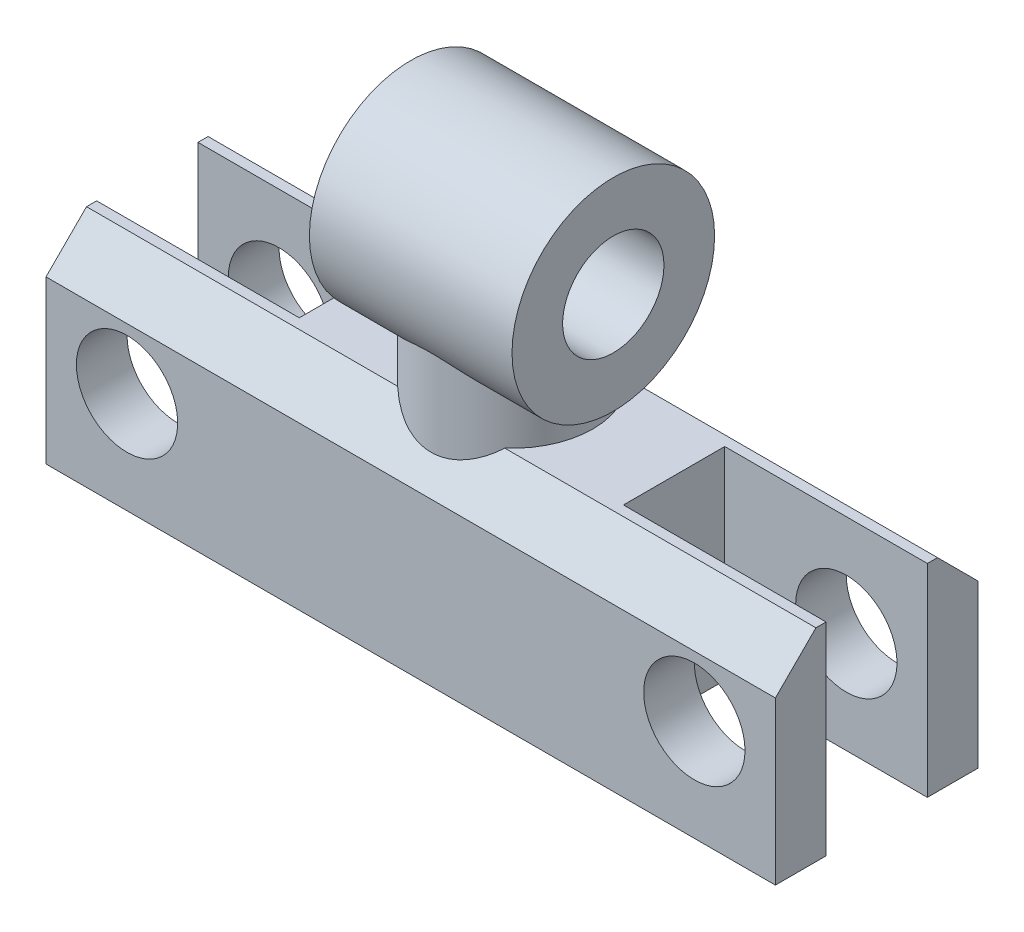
ISO-10303-21;
HEADER;
FILE_DESCRIPTION(('STEP AP214'),'2;1');
FILE_NAME('part.step','',(''),(''),'','','');
FILE_SCHEMA(('AUTOMOTIVE_DESIGN { 1 0 10303 214 1 1 1 1 }'));
ENDSEC;
DATA;
#1=APPLICATION_CONTEXT('core data for automotive mechanical design processes');
#2=APPLICATION_PROTOCOL_DEFINITION('international standard','automotive_design',2000,#1);
#3=PRODUCT_CONTEXT('',#1,'mechanical');
#4=PRODUCT('Part','Part','',(#3));
#5=PRODUCT_RELATED_PRODUCT_CATEGORY('part','',(#4));
#6=PRODUCT_DEFINITION_FORMATION('','',#4);
#7=PRODUCT_DEFINITION_CONTEXT('part definition',#1,'design');
#8=PRODUCT_DEFINITION('design','',#6,#7);
#9=PRODUCT_DEFINITION_SHAPE('','',#8);
#10=(LENGTH_UNIT() NAMED_UNIT(*) SI_UNIT(.MILLI.,.METRE.));
#11=(NAMED_UNIT(*) PLANE_ANGLE_UNIT() SI_UNIT($,.RADIAN.));
#12=(NAMED_UNIT(*) SI_UNIT($,.STERADIAN.) SOLID_ANGLE_UNIT());
#13=UNCERTAINTY_MEASURE_WITH_UNIT(LENGTH_MEASURE(1.E-05),#10,'distance_accuracy_value','');
#14=(GEOMETRIC_REPRESENTATION_CONTEXT(3) GLOBAL_UNCERTAINTY_ASSIGNED_CONTEXT((#13)) GLOBAL_UNIT_ASSIGNED_CONTEXT((#10,
#11,#12)) REPRESENTATION_CONTEXT('',''));
#15=CARTESIAN_POINT('',(0.,0.,0.));
#16=DIRECTION('',(0.,0.,1.));
#17=DIRECTION('',(1.,0.,0.));
#18=AXIS2_PLACEMENT_3D('',#15,#16,#17);
#19=CARTESIAN_POINT('',(18.,10.,5.));
#20=DIRECTION('',(0.,-1.,0.));
#21=DIRECTION('',(1.,0.,0.));
#22=AXIS2_PLACEMENT_3D('',#19,#20,#21);
#23=PLANE('',#22);
#24=DIRECTION('',(0.,0.,-1.));
#25=VECTOR('',#24,1.);
#26=CARTESIAN_POINT('',(18.,10.,5.));
#27=LINE('',#26,#25);
#28=CARTESIAN_POINT('',(18.,10.,-2.5));
#29=VERTEX_POINT('',#28);
#30=CARTESIAN_POINT('',(18.,10.,-2.99999999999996));
#31=VERTEX_POINT('',#30);
#32=EDGE_CURVE('E169',#29,#31,#27,.T.);
#33=ORIENTED_EDGE('',*,*,#32,.T.);
#34=DIRECTION('',(-1.,0.,0.));
#35=VECTOR('',#34,1.);
#36=CARTESIAN_POINT('',(18.,10.,-2.99999999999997));
#37=LINE('',#36,#35);
#38=CARTESIAN_POINT('',(2.64575131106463,9.9999999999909,-2.99999999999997));
#39=VERTEX_POINT('',#38);
#40=EDGE_CURVE('E221',#31,#39,#37,.T.);
#41=ORIENTED_EDGE('',*,*,#40,.T.);
#42=CARTESIAN_POINT('',(0.,9.99999999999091,0.));
#43=DIRECTION('',(0.,-1.,0.));
#44=DIRECTION('',(1.,0.,0.));
#45=AXIS2_PLACEMENT_3D('',#42,#43,#44);
#46=CIRCLE('',#45,4.);
#47=CARTESIAN_POINT('',(2.64575131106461,9.9999999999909,2.99999999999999));
#48=VERTEX_POINT('',#47);
#49=EDGE_CURVE('E195',#48,#39,#46,.F.);
#50=ORIENTED_EDGE('',*,*,#49,.F.);
#51=DIRECTION('',(1.,0.,0.));
#52=VECTOR('',#51,1.);
#53=CARTESIAN_POINT('',(18.,10.,2.99999999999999));
#54=LINE('',#53,#52);
#55=CARTESIAN_POINT('',(18.,10.,2.99999999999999));
#56=VERTEX_POINT('',#55);
#57=EDGE_CURVE('E215',#48,#56,#54,.T.);
#58=ORIENTED_EDGE('',*,*,#57,.T.);
#59=CARTESIAN_POINT('',(18.,10.,2.5));
#60=VERTEX_POINT('',#59);
#61=EDGE_CURVE('E193',#56,#60,#27,.T.);
#62=ORIENTED_EDGE('',*,*,#61,.T.);
#63=DIRECTION('',(1.,0.,0.));
#64=VECTOR('',#63,1.);
#65=CARTESIAN_POINT('',(18.,10.,2.5));
#66=LINE('',#65,#64);
#67=CARTESIAN_POINT('',(8.,10.,2.5));
#68=VERTEX_POINT('',#67);
#69=EDGE_CURVE('E160',#68,#60,#66,.T.);
#70=ORIENTED_EDGE('',*,*,#69,.F.);
#71=DIRECTION('',(0.,0.,1.));
#72=VECTOR('',#71,1.);
#73=CARTESIAN_POINT('',(8.,10.,2.5));
#74=LINE('',#73,#72);
#75=CARTESIAN_POINT('',(8.,10.,-2.5));
#76=VERTEX_POINT('',#75);
#77=EDGE_CURVE('E309',#76,#68,#74,.T.);
#78=ORIENTED_EDGE('',*,*,#77,.F.);
#79=DIRECTION('',(-1.,0.,0.));
#80=VECTOR('',#79,1.);
#81=CARTESIAN_POINT('',(18.,10.,-2.5));
#82=LINE('',#81,#80);
#83=EDGE_CURVE('E312',#29,#76,#82,.T.);
#84=ORIENTED_EDGE('',*,*,#83,.F.);
#85=EDGE_LOOP('',(#33,#41,#50,#58,#62,#70,#78,#84));
#86=FACE_BOUND('',#85,.T.);
#87=ADVANCED_FACE('F34',(#86),#23,.F.);
#88=CARTESIAN_POINT('',(-2.64575131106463,9.99999999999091,-2.99999999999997));
#89=VERTEX_POINT('',#88);
#90=CARTESIAN_POINT('',(-2.64575131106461,9.99999999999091,2.99999999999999));
#91=VERTEX_POINT('',#90);
#92=EDGE_CURVE('E214',#89,#91,#46,.F.);
#93=ORIENTED_EDGE('',*,*,#92,.F.);
#94=DIRECTION('',(-1.,0.,0.));
#95=VECTOR('',#94,1.);
#96=CARTESIAN_POINT('',(18.,10.,-2.99999999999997));
#97=LINE('',#96,#95);
#98=CARTESIAN_POINT('',(-18.,10.,-2.99999999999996));
#99=VERTEX_POINT('',#98);
#100=EDGE_CURVE('E219',#89,#99,#97,.T.);
#101=ORIENTED_EDGE('',*,*,#100,.T.);
#102=DIRECTION('',(0.,0.,-1.));
#103=VECTOR('',#102,1.);
#104=CARTESIAN_POINT('',(-18.,10.,5.));
#105=LINE('',#104,#103);
#106=CARTESIAN_POINT('',(-18.,10.,-2.5));
#107=VERTEX_POINT('',#106);
#108=EDGE_CURVE('E190',#107,#99,#105,.T.);
#109=ORIENTED_EDGE('',*,*,#108,.F.);
#110=DIRECTION('',(-1.,0.,0.));
#111=VECTOR('',#110,1.);
#112=CARTESIAN_POINT('',(-18.,10.,-2.5));
#113=LINE('',#112,#111);
#114=CARTESIAN_POINT('',(-8.,10.,-2.5));
#115=VERTEX_POINT('',#114);
#116=EDGE_CURVE('E287',#115,#107,#113,.T.);
#117=ORIENTED_EDGE('',*,*,#116,.F.);
#118=DIRECTION('',(0.,0.,-1.));
#119=VECTOR('',#118,1.);
#120=CARTESIAN_POINT('',(-8.,10.,-2.5));
#121=LINE('',#120,#119);
#122=CARTESIAN_POINT('',(-8.,10.,2.5));
#123=VERTEX_POINT('',#122);
#124=EDGE_CURVE('E290',#123,#115,#121,.T.);
#125=ORIENTED_EDGE('',*,*,#124,.F.);
#126=DIRECTION('',(1.,0.,0.));
#127=VECTOR('',#126,1.);
#128=CARTESIAN_POINT('',(-18.,10.,2.5));
#129=LINE('',#128,#127);
#130=CARTESIAN_POINT('',(-18.,10.,2.5));
#131=VERTEX_POINT('',#130);
#132=EDGE_CURVE('E211',#131,#123,#129,.T.);
#133=ORIENTED_EDGE('',*,*,#132,.F.);
#134=CARTESIAN_POINT('',(-18.,10.,2.99999999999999));
#135=VERTEX_POINT('',#134);
#136=EDGE_CURVE('E191',#135,#131,#105,.T.);
#137=ORIENTED_EDGE('',*,*,#136,.F.);
#138=DIRECTION('',(1.,0.,0.));
#139=VECTOR('',#138,1.);
#140=CARTESIAN_POINT('',(18.,10.,2.99999999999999));
#141=LINE('',#140,#139);
#142=EDGE_CURVE('E217',#135,#91,#141,.T.);
#143=ORIENTED_EDGE('',*,*,#142,.T.);
#144=EDGE_LOOP('',(#93,#101,#109,#117,#125,#133,#137,#143));
#145=FACE_BOUND('',#144,.T.);
#146=ADVANCED_FACE('F244',(#145),#23,.F.);
#147=CARTESIAN_POINT('',(18.,0.,5.));
#148=DIRECTION('',(-1.,0.,0.));
#149=DIRECTION('',(0.,-1.,0.));
#150=AXIS2_PLACEMENT_3D('',#147,#148,#149);
#151=PLANE('',#150);
#152=ORIENTED_EDGE('',*,*,#61,.F.);
#153=DIRECTION('',(0.,-0.707106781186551,0.707106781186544));
#154=VECTOR('',#153,1.);
#155=CARTESIAN_POINT('',(18.,7.99999999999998,5.));
#156=LINE('',#155,#154);
#157=CARTESIAN_POINT('',(18.,7.99999999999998,5.));
#158=VERTEX_POINT('',#157);
#159=EDGE_CURVE('E57',#56,#158,#156,.T.);
#160=ORIENTED_EDGE('',*,*,#159,.T.);
#161=DIRECTION('',(0.,1.,0.));
#162=VECTOR('',#161,1.);
#163=CARTESIAN_POINT('',(18.,0.,5.));
#164=LINE('',#163,#162);
#165=CARTESIAN_POINT('',(18.,0.,5.));
#166=VERTEX_POINT('',#165);
#167=EDGE_CURVE('E262',#166,#158,#164,.T.);
#168=ORIENTED_EDGE('',*,*,#167,.F.);
#169=DIRECTION('',(0.,0.,-1.));
#170=VECTOR('',#169,1.);
#171=CARTESIAN_POINT('',(18.,0.,5.));
#172=LINE('',#171,#170);
#173=CARTESIAN_POINT('',(18.,0.,2.5));
#174=VERTEX_POINT('',#173);
#175=EDGE_CURVE('E177',#166,#174,#172,.T.);
#176=ORIENTED_EDGE('',*,*,#175,.T.);
#177=DIRECTION('',(0.,1.,0.));
#178=VECTOR('',#177,1.);
#179=CARTESIAN_POINT('',(18.,0.,2.5));
#180=LINE('',#179,#178);
#181=EDGE_CURVE('E208',#174,#60,#180,.T.);
#182=ORIENTED_EDGE('',*,*,#181,.T.);
#183=EDGE_LOOP('',(#152,#160,#168,#176,#182));
#184=FACE_BOUND('',#183,.T.);
#185=ADVANCED_FACE('F357',(#184),#151,.F.);
#186=CARTESIAN_POINT('',(14.,5.,5.));
#187=DIRECTION('',(0.,0.,-1.));
#188=DIRECTION('',(-1.,0.,0.));
#189=AXIS2_PLACEMENT_3D('',#186,#187,#188);
#190=CYLINDRICAL_SURFACE('',#189,2.5);
#191=CARTESIAN_POINT('',(14.,5.,2.5));
#192=DIRECTION('',(0.,0.,1.));
#193=DIRECTION('',(1.,0.,0.));
#194=AXIS2_PLACEMENT_3D('',#191,#192,#193);
#195=CIRCLE('',#194,2.5);
#196=CARTESIAN_POINT('',(16.5,5.,2.5));
#197=VERTEX_POINT('',#196);
#198=EDGE_CURVE('E207',#197,#197,#195,.T.);
#199=ORIENTED_EDGE('',*,*,#198,.F.);
#200=EDGE_LOOP('',(#199));
#201=FACE_BOUND('',#200,.T.);
#202=CARTESIAN_POINT('',(14.,5.,5.));
#203=DIRECTION('',(0.,0.,1.));
#204=DIRECTION('',(1.,0.,0.));
#205=AXIS2_PLACEMENT_3D('',#202,#203,#204);
#206=CIRCLE('',#205,2.5);
#207=CARTESIAN_POINT('',(16.5,5.,5.));
#208=VERTEX_POINT('',#207);
#209=EDGE_CURVE('E263',#208,#208,#206,.T.);
#210=ORIENTED_EDGE('',*,*,#209,.T.);
#211=EDGE_LOOP('',(#210));
#212=FACE_BOUND('',#211,.T.);
#213=ADVANCED_FACE('F372',(#201,#212),#190,.F.);
#214=CARTESIAN_POINT('',(-18.,0.,5.));
#215=DIRECTION('',(1.,0.,0.));
#216=DIRECTION('',(0.,1.,0.));
#217=AXIS2_PLACEMENT_3D('',#214,#215,#216);
#218=PLANE('',#217);
#219=ORIENTED_EDGE('',*,*,#108,.T.);
#220=DIRECTION('',(0.,0.707106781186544,0.707106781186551));
#221=VECTOR('',#220,1.);
#222=CARTESIAN_POINT('',(-18.,10.,-2.99999999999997));
#223=LINE('',#222,#221);
#224=CARTESIAN_POINT('',(-18.,8.00000000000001,-5.));
#225=VERTEX_POINT('',#224);
#226=EDGE_CURVE('E224',#99,#225,#223,.F.);
#227=ORIENTED_EDGE('',*,*,#226,.T.);
#228=DIRECTION('',(0.,-1.,0.));
#229=VECTOR('',#228,1.);
#230=CARTESIAN_POINT('',(-18.,0.,-5.));
#231=LINE('',#230,#229);
#232=CARTESIAN_POINT('',(-18.,0.,-5.));
#233=VERTEX_POINT('',#232);
#234=EDGE_CURVE('E256',#225,#233,#231,.T.);
#235=ORIENTED_EDGE('',*,*,#234,.T.);
#236=DIRECTION('',(0.,0.,-1.));
#237=VECTOR('',#236,1.);
#238=CARTESIAN_POINT('',(-18.,0.,5.));
#239=LINE('',#238,#237);
#240=CARTESIAN_POINT('',(-18.,0.,-2.5));
#241=VERTEX_POINT('',#240);
#242=EDGE_CURVE('E181',#241,#233,#239,.T.);
#243=ORIENTED_EDGE('',*,*,#242,.F.);
#244=DIRECTION('',(0.,1.,0.));
#245=VECTOR('',#244,1.);
#246=CARTESIAN_POINT('',(-18.,0.,-2.5));
#247=LINE('',#246,#245);
#248=EDGE_CURVE('E200',#241,#107,#247,.T.);
#249=ORIENTED_EDGE('',*,*,#248,.T.);
#250=EDGE_LOOP('',(#219,#227,#235,#243,#249));
#251=FACE_BOUND('',#250,.T.);
#252=ADVANCED_FACE('F254',(#251),#218,.F.);
#253=CARTESIAN_POINT('',(-14.,5.,5.));
#254=DIRECTION('',(0.,0.,-1.));
#255=DIRECTION('',(-1.,0.,0.));
#256=AXIS2_PLACEMENT_3D('',#253,#254,#255);
#257=CYLINDRICAL_SURFACE('',#256,2.5);
#258=CARTESIAN_POINT('',(-14.,5.,-2.5));
#259=DIRECTION('',(0.,0.,-1.));
#260=DIRECTION('',(-1.,0.,0.));
#261=AXIS2_PLACEMENT_3D('',#258,#259,#260);
#262=CIRCLE('',#261,2.5);
#263=CARTESIAN_POINT('',(-16.5,5.,-2.5));
#264=VERTEX_POINT('',#263);
#265=EDGE_CURVE('E199',#264,#264,#262,.T.);
#266=ORIENTED_EDGE('',*,*,#265,.F.);
#267=EDGE_LOOP('',(#266));
#268=FACE_BOUND('',#267,.T.);
#269=CARTESIAN_POINT('',(-14.,5.,-5.));
#270=DIRECTION('',(0.,0.,1.));
#271=DIRECTION('',(-1.,0.,0.));
#272=AXIS2_PLACEMENT_3D('',#269,#270,#271);
#273=CIRCLE('',#272,2.5);
#274=CARTESIAN_POINT('',(-16.5,5.,-5.));
#275=VERTEX_POINT('',#274);
#276=EDGE_CURVE('E203',#275,#275,#273,.T.);
#277=ORIENTED_EDGE('',*,*,#276,.F.);
#278=EDGE_LOOP('',(#277));
#279=FACE_BOUND('',#278,.T.);
#280=ADVANCED_FACE('F419',(#268,#279),#257,.F.);
#281=CARTESIAN_POINT('',(18.,10.,5.));
#282=DIRECTION('',(0.,0.,1.));
#283=DIRECTION('',(1.,0.,0.));
#284=AXIS2_PLACEMENT_3D('',#281,#282,#283);
#285=PLANE('',#284);
#286=ORIENTED_EDGE('',*,*,#209,.F.);
#287=EDGE_LOOP('',(#286));
#288=FACE_BOUND('',#287,.T.);
#289=ORIENTED_EDGE('',*,*,#167,.T.);
#290=DIRECTION('',(-1.,0.,0.));
#291=VECTOR('',#290,1.);
#292=CARTESIAN_POINT('',(-18.,7.99999999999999,5.));
#293=LINE('',#292,#291);
#294=CARTESIAN_POINT('',(-18.,7.99999999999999,5.));
#295=VERTEX_POINT('',#294);
#296=EDGE_CURVE('E230',#158,#295,#293,.T.);
#297=ORIENTED_EDGE('',*,*,#296,.T.);
#298=DIRECTION('',(0.,-1.,0.));
#299=VECTOR('',#298,1.);
#300=CARTESIAN_POINT('',(-18.,0.,5.));
#301=LINE('',#300,#299);
#302=CARTESIAN_POINT('',(-18.,0.,5.));
#303=VERTEX_POINT('',#302);
#304=EDGE_CURVE('E182',#295,#303,#301,.T.);
#305=ORIENTED_EDGE('',*,*,#304,.T.);
#306=DIRECTION('',(1.,0.,0.));
#307=VECTOR('',#306,1.);
#308=CARTESIAN_POINT('',(-18.,0.,5.));
#309=LINE('',#308,#307);
#310=EDGE_CURVE('E178',#303,#166,#309,.T.);
#311=ORIENTED_EDGE('',*,*,#310,.T.);
#312=EDGE_LOOP('',(#289,#297,#305,#311));
#313=FACE_BOUND('',#312,.T.);
#314=CARTESIAN_POINT('',(-14.,5.,5.));
#315=DIRECTION('',(0.,0.,1.));
#316=DIRECTION('',(-1.,0.,0.));
#317=AXIS2_PLACEMENT_3D('',#314,#315,#316);
#318=CIRCLE('',#317,2.5);
#319=CARTESIAN_POINT('',(-16.5,5.,5.));
#320=VERTEX_POINT('',#319);
#321=EDGE_CURVE('E271',#320,#320,#318,.T.);
#322=ORIENTED_EDGE('',*,*,#321,.F.);
#323=EDGE_LOOP('',(#322));
#324=FACE_BOUND('',#323,.T.);
#325=ADVANCED_FACE('F368',(#288,#313,#324),#285,.T.);
#326=CARTESIAN_POINT('',(18.,10.,-5.));
#327=DIRECTION('',(0.,0.,1.));
#328=DIRECTION('',(1.,0.,0.));
#329=AXIS2_PLACEMENT_3D('',#326,#327,#328);
#330=PLANE('',#329);
#331=CARTESIAN_POINT('',(14.,5.,-5.));
#332=DIRECTION('',(0.,0.,1.));
#333=DIRECTION('',(1.,0.,0.));
#334=AXIS2_PLACEMENT_3D('',#331,#332,#333);
#335=CIRCLE('',#334,2.5);
#336=CARTESIAN_POINT('',(16.5,5.,-5.));
#337=VERTEX_POINT('',#336);
#338=EDGE_CURVE('E268',#337,#337,#335,.T.);
#339=ORIENTED_EDGE('',*,*,#338,.T.);
#340=EDGE_LOOP('',(#339));
#341=FACE_BOUND('',#340,.T.);
#342=ORIENTED_EDGE('',*,*,#234,.F.);
#343=DIRECTION('',(1.,0.,0.));
#344=VECTOR('',#343,1.);
#345=CARTESIAN_POINT('',(18.,8.,-5.));
#346=LINE('',#345,#344);
#347=CARTESIAN_POINT('',(18.,8.,-5.));
#348=VERTEX_POINT('',#347);
#349=EDGE_CURVE('E226',#225,#348,#346,.T.);
#350=ORIENTED_EDGE('',*,*,#349,.T.);
#351=DIRECTION('',(0.,1.,0.));
#352=VECTOR('',#351,1.);
#353=CARTESIAN_POINT('',(18.,0.,-5.));
#354=LINE('',#353,#352);
#355=CARTESIAN_POINT('',(18.,0.,-5.));
#356=VERTEX_POINT('',#355);
#357=EDGE_CURVE('E261',#356,#348,#354,.T.);
#358=ORIENTED_EDGE('',*,*,#357,.F.);
#359=DIRECTION('',(1.,0.,0.));
#360=VECTOR('',#359,1.);
#361=CARTESIAN_POINT('',(-18.,0.,-5.));
#362=LINE('',#361,#360);
#363=EDGE_CURVE('E175',#233,#356,#362,.T.);
#364=ORIENTED_EDGE('',*,*,#363,.F.);
#365=EDGE_LOOP('',(#342,#350,#358,#364));
#366=FACE_BOUND('',#365,.T.);
#367=ORIENTED_EDGE('',*,*,#276,.T.);
#368=EDGE_LOOP('',(#367));
#369=FACE_BOUND('',#368,.T.);
#370=ADVANCED_FACE('F259',(#341,#366,#369),#330,.F.);
#371=ORIENTED_EDGE('',*,*,#357,.T.);
#372=DIRECTION('',(0.,-0.707106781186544,-0.707106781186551));
#373=VECTOR('',#372,1.);
#374=CARTESIAN_POINT('',(18.,10.,-2.99999999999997));
#375=LINE('',#374,#373);
#376=EDGE_CURVE('E228',#348,#31,#375,.F.);
#377=ORIENTED_EDGE('',*,*,#376,.T.);
#378=ORIENTED_EDGE('',*,*,#32,.F.);
#379=DIRECTION('',(0.,1.,0.));
#380=VECTOR('',#379,1.);
#381=CARTESIAN_POINT('',(18.,0.,-2.5));
#382=LINE('',#381,#380);
#383=CARTESIAN_POINT('',(18.,0.,-2.5));
#384=VERTEX_POINT('',#383);
#385=EDGE_CURVE('E153',#384,#29,#382,.T.);
#386=ORIENTED_EDGE('',*,*,#385,.F.);
#387=EDGE_CURVE('E166',#384,#356,#172,.T.);
#388=ORIENTED_EDGE('',*,*,#387,.T.);
#389=EDGE_LOOP('',(#371,#377,#378,#386,#388));
#390=FACE_BOUND('',#389,.T.);
#391=ADVANCED_FACE('F165',(#390),#151,.F.);
#392=ORIENTED_EDGE('',*,*,#304,.F.);
#393=DIRECTION('',(0.,0.707106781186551,-0.707106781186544));
#394=VECTOR('',#393,1.);
#395=CARTESIAN_POINT('',(-18.,7.99999999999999,5.));
#396=LINE('',#395,#394);
#397=EDGE_CURVE('E49',#295,#135,#396,.T.);
#398=ORIENTED_EDGE('',*,*,#397,.T.);
#399=ORIENTED_EDGE('',*,*,#136,.T.);
#400=DIRECTION('',(0.,1.,0.));
#401=VECTOR('',#400,1.);
#402=CARTESIAN_POINT('',(-18.,0.,2.5));
#403=LINE('',#402,#401);
#404=CARTESIAN_POINT('',(-18.,0.,2.5));
#405=VERTEX_POINT('',#404);
#406=EDGE_CURVE('E278',#405,#131,#403,.T.);
#407=ORIENTED_EDGE('',*,*,#406,.F.);
#408=EDGE_CURVE('E187',#303,#405,#239,.T.);
#409=ORIENTED_EDGE('',*,*,#408,.F.);
#410=EDGE_LOOP('',(#392,#398,#399,#407,#409));
#411=FACE_BOUND('',#410,.T.);
#412=ADVANCED_FACE('F360',(#411),#218,.F.);
#413=CARTESIAN_POINT('',(-18.,0.,5.));
#414=DIRECTION('',(0.,1.,0.));
#415=DIRECTION('',(-1.,0.,0.));
#416=AXIS2_PLACEMENT_3D('',#413,#414,#415);
#417=PLANE('',#416);
#418=DIRECTION('',(0.,0.,1.));
#419=VECTOR('',#418,1.);
#420=CARTESIAN_POINT('',(8.,0.,2.5));
#421=LINE('',#420,#419);
#422=CARTESIAN_POINT('',(8.,0.,-2.5));
#423=VERTEX_POINT('',#422);
#424=CARTESIAN_POINT('',(8.,0.,2.5));
#425=VERTEX_POINT('',#424);
#426=EDGE_CURVE('E159',#423,#425,#421,.T.);
#427=ORIENTED_EDGE('',*,*,#426,.T.);
#428=DIRECTION('',(1.,0.,0.));
#429=VECTOR('',#428,1.);
#430=CARTESIAN_POINT('',(18.,0.,2.5));
#431=LINE('',#430,#429);
#432=EDGE_CURVE('E170',#425,#174,#431,.T.);
#433=ORIENTED_EDGE('',*,*,#432,.T.);
#434=ORIENTED_EDGE('',*,*,#175,.F.);
#435=ORIENTED_EDGE('',*,*,#310,.F.);
#436=ORIENTED_EDGE('',*,*,#408,.T.);
#437=DIRECTION('',(1.,0.,0.));
#438=VECTOR('',#437,1.);
#439=CARTESIAN_POINT('',(-18.,0.,2.5));
#440=LINE('',#439,#438);
#441=CARTESIAN_POINT('',(-8.,0.,2.5));
#442=VERTEX_POINT('',#441);
#443=EDGE_CURVE('E289',#405,#442,#440,.T.);
#444=ORIENTED_EDGE('',*,*,#443,.T.);
#445=DIRECTION('',(0.,0.,-1.));
#446=VECTOR('',#445,1.);
#447=CARTESIAN_POINT('',(-8.,0.,-2.5));
#448=LINE('',#447,#446);
#449=CARTESIAN_POINT('',(-8.,0.,-2.5));
#450=VERTEX_POINT('',#449);
#451=EDGE_CURVE('E297',#442,#450,#448,.T.);
#452=ORIENTED_EDGE('',*,*,#451,.T.);
#453=DIRECTION('',(-1.,0.,0.));
#454=VECTOR('',#453,1.);
#455=CARTESIAN_POINT('',(-18.,0.,-2.5));
#456=LINE('',#455,#454);
#457=EDGE_CURVE('E282',#450,#241,#456,.T.);
#458=ORIENTED_EDGE('',*,*,#457,.T.);
#459=ORIENTED_EDGE('',*,*,#242,.T.);
#460=ORIENTED_EDGE('',*,*,#363,.T.);
#461=ORIENTED_EDGE('',*,*,#387,.F.);
#462=DIRECTION('',(-1.,0.,0.));
#463=VECTOR('',#462,1.);
#464=CARTESIAN_POINT('',(18.,0.,-2.5));
#465=LINE('',#464,#463);
#466=EDGE_CURVE('E149',#384,#423,#465,.T.);
#467=ORIENTED_EDGE('',*,*,#466,.T.);
#468=EDGE_LOOP('',(#427,#433,#434,#435,#436,#444,#452,#458,#459,#460,#461,#467));
#469=FACE_BOUND('',#468,.T.);
#470=ADVANCED_FACE('F172',(#469),#417,.F.);
#471=CARTESIAN_POINT('',(14.,5.,-2.5));
#472=DIRECTION('',(0.,0.,-1.));
#473=DIRECTION('',(-1.,0.,0.));
#474=AXIS2_PLACEMENT_3D('',#471,#472,#473);
#475=CIRCLE('',#474,2.5);
#476=CARTESIAN_POINT('',(11.5,5.,-2.5));
#477=VERTEX_POINT('',#476);
#478=EDGE_CURVE('E204',#477,#477,#475,.T.);
#479=ORIENTED_EDGE('',*,*,#478,.F.);
#480=EDGE_LOOP('',(#479));
#481=FACE_BOUND('',#480,.T.);
#482=ORIENTED_EDGE('',*,*,#338,.F.);
#483=EDGE_LOOP('',(#482));
#484=FACE_BOUND('',#483,.T.);
#485=ADVANCED_FACE('F378',(#481,#484),#190,.F.);
#486=CARTESIAN_POINT('',(-14.,5.,2.5));
#487=DIRECTION('',(0.,0.,1.));
#488=DIRECTION('',(1.,0.,0.));
#489=AXIS2_PLACEMENT_3D('',#486,#487,#488);
#490=CIRCLE('',#489,2.5);
#491=CARTESIAN_POINT('',(-11.5,5.,2.5));
#492=VERTEX_POINT('',#491);
#493=EDGE_CURVE('E196',#492,#492,#490,.T.);
#494=ORIENTED_EDGE('',*,*,#493,.F.);
#495=EDGE_LOOP('',(#494));
#496=FACE_BOUND('',#495,.T.);
#497=ORIENTED_EDGE('',*,*,#321,.T.);
#498=EDGE_LOOP('',(#497));
#499=FACE_BOUND('',#498,.T.);
#500=ADVANCED_FACE('F409',(#496,#499),#257,.F.);
#501=CARTESIAN_POINT('',(-18.,0.,-2.5));
#502=DIRECTION('',(0.,0.,-1.));
#503=DIRECTION('',(-1.,0.,0.));
#504=AXIS2_PLACEMENT_3D('',#501,#502,#503);
#505=PLANE('',#504);
#506=ORIENTED_EDGE('',*,*,#265,.T.);
#507=EDGE_LOOP('',(#506));
#508=FACE_BOUND('',#507,.T.);
#509=ORIENTED_EDGE('',*,*,#116,.T.);
#510=ORIENTED_EDGE('',*,*,#248,.F.);
#511=ORIENTED_EDGE('',*,*,#457,.F.);
#512=DIRECTION('',(0.,1.,0.));
#513=VECTOR('',#512,1.);
#514=CARTESIAN_POINT('',(-8.,0.,-2.5));
#515=LINE('',#514,#513);
#516=EDGE_CURVE('E284',#450,#115,#515,.T.);
#517=ORIENTED_EDGE('',*,*,#516,.T.);
#518=EDGE_LOOP('',(#509,#510,#511,#517));
#519=FACE_BOUND('',#518,.T.);
#520=ADVANCED_FACE('F405',(#508,#519),#505,.F.);
#521=CARTESIAN_POINT('',(-8.,0.,-2.5));
#522=DIRECTION('',(1.,0.,0.));
#523=DIRECTION('',(0.,1.,0.));
#524=AXIS2_PLACEMENT_3D('',#521,#522,#523);
#525=PLANE('',#524);
#526=ORIENTED_EDGE('',*,*,#124,.T.);
#527=ORIENTED_EDGE('',*,*,#516,.F.);
#528=ORIENTED_EDGE('',*,*,#451,.F.);
#529=DIRECTION('',(0.,1.,0.));
#530=VECTOR('',#529,1.);
#531=CARTESIAN_POINT('',(-8.,0.,2.5));
#532=LINE('',#531,#530);
#533=EDGE_CURVE('E281',#442,#123,#532,.T.);
#534=ORIENTED_EDGE('',*,*,#533,.T.);
#535=EDGE_LOOP('',(#526,#527,#528,#534));
#536=FACE_BOUND('',#535,.T.);
#537=ADVANCED_FACE('F408',(#536),#525,.F.);
#538=CARTESIAN_POINT('',(-18.,0.,2.5));
#539=DIRECTION('',(0.,0.,1.));
#540=DIRECTION('',(1.,0.,0.));
#541=AXIS2_PLACEMENT_3D('',#538,#539,#540);
#542=PLANE('',#541);
#543=ORIENTED_EDGE('',*,*,#493,.T.);
#544=EDGE_LOOP('',(#543));
#545=FACE_BOUND('',#544,.T.);
#546=ORIENTED_EDGE('',*,*,#132,.T.);
#547=ORIENTED_EDGE('',*,*,#533,.F.);
#548=ORIENTED_EDGE('',*,*,#443,.F.);
#549=ORIENTED_EDGE('',*,*,#406,.T.);
#550=EDGE_LOOP('',(#546,#547,#548,#549));
#551=FACE_BOUND('',#550,.T.);
#552=ADVANCED_FACE('F402',(#545,#551),#542,.F.);
#553=CARTESIAN_POINT('',(18.,0.,2.5));
#554=DIRECTION('',(0.,0.,1.));
#555=DIRECTION('',(1.,0.,0.));
#556=AXIS2_PLACEMENT_3D('',#553,#554,#555);
#557=PLANE('',#556);
#558=ORIENTED_EDGE('',*,*,#198,.T.);
#559=EDGE_LOOP('',(#558));
#560=FACE_BOUND('',#559,.T.);
#561=ORIENTED_EDGE('',*,*,#69,.T.);
#562=ORIENTED_EDGE('',*,*,#181,.F.);
#563=ORIENTED_EDGE('',*,*,#432,.F.);
#564=DIRECTION('',(0.,1.,0.));
#565=VECTOR('',#564,1.);
#566=CARTESIAN_POINT('',(8.,0.,2.5));
#567=LINE('',#566,#565);
#568=EDGE_CURVE('E303',#425,#68,#567,.T.);
#569=ORIENTED_EDGE('',*,*,#568,.T.);
#570=EDGE_LOOP('',(#561,#562,#563,#569));
#571=FACE_BOUND('',#570,.T.);
#572=ADVANCED_FACE('F390',(#560,#571),#557,.F.);
#573=CARTESIAN_POINT('',(8.,0.,2.5));
#574=DIRECTION('',(-1.,0.,0.));
#575=DIRECTION('',(0.,0.,1.));
#576=AXIS2_PLACEMENT_3D('',#573,#574,#575);
#577=PLANE('',#576);
#578=ORIENTED_EDGE('',*,*,#77,.T.);
#579=ORIENTED_EDGE('',*,*,#568,.F.);
#580=ORIENTED_EDGE('',*,*,#426,.F.);
#581=DIRECTION('',(0.,1.,0.));
#582=VECTOR('',#581,1.);
#583=CARTESIAN_POINT('',(8.,0.,-2.5));
#584=LINE('',#583,#582);
#585=EDGE_CURVE('E155',#423,#76,#584,.T.);
#586=ORIENTED_EDGE('',*,*,#585,.T.);
#587=EDGE_LOOP('',(#578,#579,#580,#586));
#588=FACE_BOUND('',#587,.T.);
#589=ADVANCED_FACE('F393',(#588),#577,.F.);
#590=CARTESIAN_POINT('',(18.,0.,-2.5));
#591=DIRECTION('',(0.,0.,-1.));
#592=DIRECTION('',(-1.,0.,0.));
#593=AXIS2_PLACEMENT_3D('',#590,#591,#592);
#594=PLANE('',#593);
#595=ORIENTED_EDGE('',*,*,#478,.T.);
#596=EDGE_LOOP('',(#595));
#597=FACE_BOUND('',#596,.T.);
#598=ORIENTED_EDGE('',*,*,#83,.T.);
#599=ORIENTED_EDGE('',*,*,#585,.F.);
#600=ORIENTED_EDGE('',*,*,#466,.F.);
#601=ORIENTED_EDGE('',*,*,#385,.T.);
#602=EDGE_LOOP('',(#598,#599,#600,#601));
#603=FACE_BOUND('',#602,.T.);
#604=ADVANCED_FACE('F152',(#597,#603),#594,.F.);
#605=CARTESIAN_POINT('',(1.68651824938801E-10,500000.,0.));
#606=DIRECTION('',(0.,-1.,0.));
#607=DIRECTION('',(1.,0.,0.));
#608=AXIS2_PLACEMENT_3D('',#605,#606,#607);
#609=CYLINDRICAL_SURFACE('',#608,4.);
#610=ORIENTED_EDGE('',*,*,#49,.T.);
#611=CARTESIAN_POINT('',(0.,13.0000000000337,0.));
#612=DIRECTION('',(0.,-0.707106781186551,0.707106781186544));
#613=DIRECTION('',(0.,-0.707106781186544,-0.707106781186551));
#614=AXIS2_PLACEMENT_3D('',#611,#612,#613);
#615=ELLIPSE('',#614,5.65685424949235,4.);
#616=EDGE_CURVE('E42',#39,#89,#615,.F.);
#617=ORIENTED_EDGE('',*,*,#616,.T.);
#618=ORIENTED_EDGE('',*,*,#92,.T.);
#619=CARTESIAN_POINT('',(0.,12.9999999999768,0.));
#620=DIRECTION('',(0.,0.707106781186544,0.707106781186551));
#621=DIRECTION('',(0.,-0.707106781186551,0.707106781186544));
#622=AXIS2_PLACEMENT_3D('',#619,#620,#621);
#623=ELLIPSE('',#622,5.65685424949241,4.);
#624=EDGE_CURVE('E11',#91,#48,#623,.T.);
#625=ORIENTED_EDGE('',*,*,#624,.T.);
#626=EDGE_LOOP('',(#610,#617,#618,#625));
#627=FACE_BOUND('',#626,.T.);
#628=CARTESIAN_POINT('',(4.,11.2500000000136,0.));
#629=CARTESIAN_POINT('',(3.99999923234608,11.2500007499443,-0.0960463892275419));
#630=CARTESIAN_POINT('',(3.99653429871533,11.2527739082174,-0.192107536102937));
#631=CARTESIAN_POINT('',(3.98273418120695,11.263803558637,-0.383456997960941));
#632=CARTESIAN_POINT('',(3.97239536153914,11.2720629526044,-0.478744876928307));
#633=CARTESIAN_POINT('',(3.945004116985,11.2938938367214,-0.667896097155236));
#634=CARTESIAN_POINT('',(3.92794075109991,11.3074739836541,-0.761756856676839));
#635=CARTESIAN_POINT('',(3.88738981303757,11.3396385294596,-0.947221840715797));
#636=CARTESIAN_POINT('',(3.86389932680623,11.3582251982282,-1.03882502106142));
#637=CARTESIAN_POINT('',(3.78466700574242,11.4206489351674,-1.30807557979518));
#638=CARTESIAN_POINT('',(3.71994896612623,11.471324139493,-1.48159866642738));
#639=CARTESIAN_POINT('',(3.56974964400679,11.5872932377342,-1.81389737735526));
#640=CARTESIAN_POINT('',(3.48426829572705,11.6525871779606,-1.97267295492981));
#641=CARTESIAN_POINT('',(3.32631313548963,11.7708717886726,-2.22486392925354));
#642=CARTESIAN_POINT('',(3.25865263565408,11.8209559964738,-2.32274021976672));
#643=CARTESIAN_POINT('',(3.11599426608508,11.9248379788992,-2.51087921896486));
#644=CARTESIAN_POINT('',(3.04099644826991,11.978635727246,-2.60114198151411));
#645=CARTESIAN_POINT('',(2.88403632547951,12.0889261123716,-2.77417073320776));
#646=CARTESIAN_POINT('',(2.80205409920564,12.145426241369,-2.85691378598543));
#647=CARTESIAN_POINT('',(2.63176020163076,12.2597397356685,-3.01451382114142));
#648=CARTESIAN_POINT('',(2.54345098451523,12.3175525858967,-3.08937383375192));
#649=CARTESIAN_POINT('',(2.35925936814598,12.4341206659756,-3.23229007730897));
#650=CARTESIAN_POINT('',(2.26327942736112,12.4928763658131,-3.30022025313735));
#651=CARTESIAN_POINT('',(2.06501675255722,12.6088706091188,-3.42776995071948));
#652=CARTESIAN_POINT('',(1.96273204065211,12.6661086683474,-3.48738684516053));
#653=CARTESIAN_POINT('',(1.75207248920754,12.7769959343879,-3.5978250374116));
#654=CARTESIAN_POINT('',(1.64371523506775,12.8306546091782,-3.64867015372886));
#655=CARTESIAN_POINT('',(1.42061730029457,12.9321253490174,-3.74117870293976));
#656=CARTESIAN_POINT('',(1.3058821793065,12.9799423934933,-3.78284998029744));
#657=CARTESIAN_POINT('',(1.05228957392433,13.0732978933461,-3.86171422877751));
#658=CARTESIAN_POINT('',(0.912389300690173,13.1174283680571,-3.89730775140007));
#659=CARTESIAN_POINT('',(0.625561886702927,13.1885993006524,-3.95346969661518));
#660=CARTESIAN_POINT('',(0.478652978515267,13.2156817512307,-3.97407505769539));
#661=CARTESIAN_POINT('',(0.179618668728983,13.2483160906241,-3.9987963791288));
#662=CARTESIAN_POINT('',(0.027458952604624,13.2536781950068,-4.00276700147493));
#663=CARTESIAN_POINT('',(-0.275411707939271,13.2412006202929,-3.99338954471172));
#664=CARTESIAN_POINT('',(-0.426121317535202,13.2233413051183,-3.9800268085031));
#665=CARTESIAN_POINT('',(-0.744439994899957,13.163585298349,-3.93390695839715));
#666=CARTESIAN_POINT('',(-0.910998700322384,13.1183617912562,-3.89843994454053));
#667=CARTESIAN_POINT('',(-1.23308848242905,13.0100521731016,-3.80888715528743));
#668=CARTESIAN_POINT('',(-1.38858523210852,12.9469132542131,-3.75474623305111));
#669=CARTESIAN_POINT('',(-1.64978371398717,12.8277236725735,-3.64593083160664));
#670=CARTESIAN_POINT('',(-1.75810078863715,12.773946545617,-3.59488537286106));
#671=CARTESIAN_POINT('',(-1.9684490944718,12.6629681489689,-3.48415594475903));
#672=CARTESIAN_POINT('',(-2.07047738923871,12.6057653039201,-3.42446798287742));
#673=CARTESIAN_POINT('',(-2.2683872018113,12.4897937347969,-3.29671153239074));
#674=CARTESIAN_POINT('',(-2.36426139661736,12.4310232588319,-3.22863333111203));
#675=CARTESIAN_POINT('',(-2.54966735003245,12.3135466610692,-3.08431402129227));
#676=CARTESIAN_POINT('',(-2.63920014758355,12.2548405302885,-3.00807425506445));
#677=CARTESIAN_POINT('',(-2.81401012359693,12.1372929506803,-2.84534419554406));
#678=CARTESIAN_POINT('',(-2.8991090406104,12.0784900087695,-2.75863401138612));
#679=CARTESIAN_POINT('',(-3.06191309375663,11.9637452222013,-2.57673993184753));
#680=CARTESIAN_POINT('',(-3.13961713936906,11.9078038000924,-2.48155479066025));
#681=CARTESIAN_POINT('',(-3.28675730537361,11.8002516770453,-2.28307653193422));
#682=CARTESIAN_POINT('',(-3.35621195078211,11.7486313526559,-2.1798024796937));
#683=CARTESIAN_POINT('',(-3.4861249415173,11.6509524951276,-1.96536649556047));
#684=CARTESIAN_POINT('',(-3.54658734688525,11.6048914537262,-1.85420815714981));
#685=CARTESIAN_POINT('',(-3.6810867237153,11.5015450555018,-1.57560055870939));
#686=CARTESIAN_POINT('',(-3.75002209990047,11.4477720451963,-1.40425498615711));
#687=CARTESIAN_POINT('',(-3.83572935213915,11.3804499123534,-1.13837354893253));
#688=CARTESIAN_POINT('',(-3.86135253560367,11.3602293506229,-1.04825004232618));
#689=CARTESIAN_POINT('',(-3.90636305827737,11.3246086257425,-0.865540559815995));
#690=CARTESIAN_POINT('',(-3.92575331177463,11.3092062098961,-0.772955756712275));
#691=CARTESIAN_POINT('',(-3.95808051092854,11.2834815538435,-0.585412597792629));
#692=CARTESIAN_POINT('',(-3.97097979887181,11.2731889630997,-0.490443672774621));
#693=CARTESIAN_POINT('',(-3.98993092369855,11.2580548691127,-0.299430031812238));
#694=CARTESIAN_POINT('',(-3.99598557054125,11.2532111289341,-0.203385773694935));
#695=CARTESIAN_POINT('',(-4.00114189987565,11.2490867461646,-0.0109789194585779));
#696=CARTESIAN_POINT('',(-4.00024314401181,11.2498064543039,0.0853836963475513));
#697=CARTESIAN_POINT('',(-3.99151942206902,11.2567822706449,0.277564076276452));
#698=CARTESIAN_POINT('',(-3.98369481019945,11.2630380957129,0.373381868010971));
#699=CARTESIAN_POINT('',(-3.95182939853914,11.2884698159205,0.643376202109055));
#700=CARTESIAN_POINT('',(-3.91970031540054,11.314074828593,0.816090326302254));
#701=CARTESIAN_POINT('',(-3.8342569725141,11.3816478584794,1.15270281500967));
#702=CARTESIAN_POINT('',(-3.78093642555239,11.4236207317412,1.31659854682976));
#703=CARTESIAN_POINT('',(-3.65169886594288,11.5242035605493,1.6424625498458));
#704=CARTESIAN_POINT('',(-3.57458832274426,11.5836818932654,1.8036847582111));
#705=CARTESIAN_POINT('',(-3.40227580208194,11.7143273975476,2.11082248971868));
#706=CARTESIAN_POINT('',(-3.30707292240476,11.7854951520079,2.25673724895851));
#707=CARTESIAN_POINT('',(-3.08155132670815,11.9501263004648,2.55850389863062));
#708=CARTESIAN_POINT('',(-2.9479966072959,12.0452606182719,2.71101415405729));
#709=CARTESIAN_POINT('',(-2.66122608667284,12.2411300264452,2.99307397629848));
#710=CARTESIAN_POINT('',(-2.50795433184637,12.3418805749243,3.12255559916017));
#711=CARTESIAN_POINT('',(-2.24713111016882,12.5025172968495,3.31136973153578));
#712=CARTESIAN_POINT('',(-2.14527881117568,12.562905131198,3.37827483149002));
#713=CARTESIAN_POINT('',(-1.93475548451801,12.6812916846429,3.50310004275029));
#714=CARTESIAN_POINT('',(-1.82608088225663,12.7392891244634,3.56101538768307));
#715=CARTESIAN_POINT('',(-1.60222148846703,12.8503377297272,3.66717546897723));
#716=CARTESIAN_POINT('',(-1.48706099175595,12.9034056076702,3.71545356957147));
#717=CARTESIAN_POINT('',(-1.24991900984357,13.0018192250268,3.80178930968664));
#718=CARTESIAN_POINT('',(-1.12794616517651,13.0471744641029,3.83985955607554));
#719=CARTESIAN_POINT('',(-0.867826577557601,13.1296115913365,3.90720331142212));
#720=CARTESIAN_POINT('',(-0.72915468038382,13.165805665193,3.93559119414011));
#721=CARTESIAN_POINT('',(-0.446324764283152,13.2201325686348,3.97757811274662));
#722=CARTESIAN_POINT('',(-0.302181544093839,13.2383109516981,3.99121445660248));
#723=CARTESIAN_POINT('',(-0.0113026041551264,13.2535052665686,4.00264117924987));
#724=CARTESIAN_POINT('',(0.135442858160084,13.2504074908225,4.00034641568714));
#725=CARTESIAN_POINT('',(0.425968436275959,13.2233845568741,3.97993037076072));
#726=CARTESIAN_POINT('',(0.569743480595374,13.1994263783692,3.96178399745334));
#727=CARTESIAN_POINT('',(0.889213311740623,13.1258585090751,3.90415501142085));
#728=CARTESIAN_POINT('',(1.06284516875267,13.0710150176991,3.86018501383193));
#729=CARTESIAN_POINT('',(1.39726795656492,12.9442216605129,3.75216313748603));
#730=CARTESIAN_POINT('',(1.55801928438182,12.8722215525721,3.68805209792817));
#731=CARTESIAN_POINT('',(1.82435028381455,12.7401785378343,3.56189718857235));
#732=CARTESIAN_POINT('',(1.93302473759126,12.6822260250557,3.50405339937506));
#733=CARTESIAN_POINT('',(2.14368098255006,12.5638419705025,3.3792939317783));
#734=CARTESIAN_POINT('',(2.24566002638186,12.5034094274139,3.3123745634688));
#735=CARTESIAN_POINT('',(2.44297278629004,12.3819154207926,3.16965616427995));
#736=CARTESIAN_POINT('',(2.53830008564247,12.3208534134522,3.09384874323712));
#737=CARTESIAN_POINT('',(2.72200370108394,12.1997483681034,2.93352249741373));
#738=CARTESIAN_POINT('',(2.81038111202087,12.1397051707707,2.84900504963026));
#739=CARTESIAN_POINT('',(2.98090824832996,12.0212881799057,2.67014072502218));
#740=CARTESIAN_POINT('',(3.06296014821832,11.9629469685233,2.57567862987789));
#741=CARTESIAN_POINT('',(3.21886299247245,11.8502065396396,2.37797638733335));
#742=CARTESIAN_POINT('',(3.29271257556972,11.7958079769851,2.27473478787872));
#743=CARTESIAN_POINT('',(3.4311365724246,11.6925247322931,2.05999159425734));
#744=CARTESIAN_POINT('',(3.49573298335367,11.6436270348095,1.94851057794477));
#745=CARTESIAN_POINT('',(3.61474010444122,11.5526732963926,1.71770987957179));
#746=CARTESIAN_POINT('',(3.66915704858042,11.5106130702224,1.59839505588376));
#747=CARTESIAN_POINT('',(3.78356181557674,11.4215816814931,1.31004257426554));
#748=CARTESIAN_POINT('',(3.83898036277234,11.3779332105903,1.13806652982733));
#749=CARTESIAN_POINT('',(3.90452402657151,11.3260645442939,0.873484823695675));
#750=CARTESIAN_POINT('',(3.92343360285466,11.3110485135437,0.784257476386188));
#751=CARTESIAN_POINT('',(3.95517978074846,11.2857929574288,0.604069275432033));
#752=CARTESIAN_POINT('',(3.96801908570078,11.2755513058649,0.513109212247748));
#753=CARTESIAN_POINT('',(3.98512135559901,11.2618968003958,0.351776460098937));
#754=CARTESIAN_POINT('',(3.99069483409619,11.2574415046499,0.281625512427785));
#755=CARTESIAN_POINT('',(3.9981348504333,11.2514924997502,0.140985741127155));
#756=CARTESIAN_POINT('',(4.00000056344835,11.249999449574,0.0704968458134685));
#757=CARTESIAN_POINT('',(4.,11.2500000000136,0.));
#758=B_SPLINE_CURVE_WITH_KNOTS('',3,(#628,#629,#630,#631,#632,#633,#634,#635,#636,#637,#638,
#639,#640,#641,#642,#643,#644,#645,#646,#647,#648,#649,#650,#651,#652,#653,#654,#655,#656,#657,
#658,#659,#660,#661,#662,#663,#664,#665,#666,#667,#668,#669,#670,#671,#672,#673,#674,#675,#676,
#677,#678,#679,#680,#681,#682,#683,#684,#685,#686,#687,#688,#689,#690,#691,#692,#693,#694,#695,
#696,#697,#698,#699,#700,#701,#702,#703,#704,#705,#706,#707,#708,#709,#710,#711,#712,#713,#714,
#715,#716,#717,#718,#719,#720,#721,#722,#723,#724,#725,#726,#727,#728,#729,#730,#731,#732,#733,
#734,#735,#736,#737,#738,#739,#740,#741,#742,#743,#744,#745,#746,#747,#748,#749,#750,#751,#752,
#753,#754,#755,#756,#757),.UNSPECIFIED.,.T.,.F.,(4,2,2,2,2,2,2,2,2,2,2,2,2,2,2,2,2,2,2,2,2,2,2,
2,2,2,2,2,2,2,2,2,2,2,2,2,2,2,2,2,2,2,2,2,2,2,2,2,2,2,2,2,2,2,2,2,2,2,2,2,2,2,2,2,4),(0.,
0.288062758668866,0.576278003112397,0.86496412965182,1.15378136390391,1.72709009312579,
2.30040063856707,2.68722645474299,3.07404953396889,3.46201544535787,3.84983167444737,
4.24376978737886,4.63783211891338,5.03080698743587,5.42344451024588,5.87474837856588,
6.32493619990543,6.77904922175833,7.23354649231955,7.7592312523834,8.2864819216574,
8.67980074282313,9.07330184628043,9.46726282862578,9.86115911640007,10.2656076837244,
10.6701158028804,11.0736976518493,11.4770967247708,12.0514034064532,12.3386733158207,
12.6258087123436,12.9145912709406,13.2032552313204,13.4919373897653,13.7806047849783,
14.310611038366,14.8407746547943,15.4037260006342,15.9667054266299,16.6361816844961,
17.307601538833,17.7152021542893,18.1230181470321,18.5293968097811,18.9352712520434,
19.3719136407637,19.8074491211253,20.2453140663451,20.6838733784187,21.2427370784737,
21.8032579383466,22.2109901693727,22.6188886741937,23.0271753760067,23.4353976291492,
23.8490189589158,24.262708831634,24.675398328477,25.0878342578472,25.6427442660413,
25.9197834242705,26.1966990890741,26.4080865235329,26.619520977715),.UNSPECIFIED.);
#759=CARTESIAN_POINT('',(4.,11.2500000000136,0.));
#760=VERTEX_POINT('',#759);
#761=EDGE_CURVE('E314',#760,#760,#758,.T.);
#762=ORIENTED_EDGE('',*,*,#761,.F.);
#763=EDGE_LOOP('',(#762));
#764=FACE_BOUND('',#763,.T.);
#765=ADVANCED_FACE('F236',(#627,#764),#609,.T.);
#766=CARTESIAN_POINT('',(5.,16.25,0.));
#767=DIRECTION('',(-1.,0.,0.));
#768=DIRECTION('',(0.,0.,1.));
#769=AXIS2_PLACEMENT_3D('',#766,#767,#768);
#770=CYLINDRICAL_SURFACE('',#769,5.);
#771=CARTESIAN_POINT('',(-5.,16.25,0.));
#772=DIRECTION('',(1.,0.,0.));
#773=DIRECTION('',(0.,0.,-1.));
#774=AXIS2_PLACEMENT_3D('',#771,#772,#773);
#775=CIRCLE('',#774,5.);
#776=CARTESIAN_POINT('',(-5.,16.25,-5.));
#777=VERTEX_POINT('',#776);
#778=EDGE_CURVE('E325',#777,#777,#775,.T.);
#779=ORIENTED_EDGE('',*,*,#778,.T.);
#780=EDGE_LOOP('',(#779));
#781=FACE_BOUND('',#780,.T.);
#782=CARTESIAN_POINT('',(5.,16.25,0.));
#783=DIRECTION('',(1.,0.,0.));
#784=DIRECTION('',(0.,0.,-1.));
#785=AXIS2_PLACEMENT_3D('',#782,#783,#784);
#786=CIRCLE('',#785,5.);
#787=CARTESIAN_POINT('',(5.,16.25,-5.));
#788=VERTEX_POINT('',#787);
#789=EDGE_CURVE('E324',#788,#788,#786,.T.);
#790=ORIENTED_EDGE('',*,*,#789,.F.);
#791=EDGE_LOOP('',(#790));
#792=FACE_BOUND('',#791,.T.);
#793=ORIENTED_EDGE('',*,*,#761,.T.);
#794=EDGE_LOOP('',(#793));
#795=FACE_BOUND('',#794,.T.);
#796=ADVANCED_FACE('F331',(#781,#792,#795),#770,.T.);
#797=CARTESIAN_POINT('',(5.,16.25,0.));
#798=DIRECTION('',(1.,0.,0.));
#799=DIRECTION('',(0.,0.,-1.));
#800=AXIS2_PLACEMENT_3D('',#797,#798,#799);
#801=PLANE('',#800);
#802=ORIENTED_EDGE('',*,*,#789,.T.);
#803=EDGE_LOOP('',(#802));
#804=FACE_BOUND('',#803,.T.);
#805=CARTESIAN_POINT('',(5.,16.25,0.));
#806=DIRECTION('',(1.,0.,0.));
#807=DIRECTION('',(0.,0.,-1.));
#808=AXIS2_PLACEMENT_3D('',#805,#806,#807);
#809=CIRCLE('',#808,2.5);
#810=CARTESIAN_POINT('',(5.,16.25,-2.5));
#811=VERTEX_POINT('',#810);
#812=EDGE_CURVE('E597',#811,#811,#809,.T.);
#813=ORIENTED_EDGE('',*,*,#812,.F.);
#814=EDGE_LOOP('',(#813));
#815=FACE_BOUND('',#814,.T.);
#816=ADVANCED_FACE('F334',(#804,#815),#801,.T.);
#817=CARTESIAN_POINT('',(-5.,16.25,0.));
#818=DIRECTION('',(1.,0.,0.));
#819=DIRECTION('',(0.,0.,-1.));
#820=AXIS2_PLACEMENT_3D('',#817,#818,#819);
#821=PLANE('',#820);
#822=ORIENTED_EDGE('',*,*,#778,.F.);
#823=EDGE_LOOP('',(#822));
#824=FACE_BOUND('',#823,.T.);
#825=CARTESIAN_POINT('',(-5.,16.25,0.));
#826=DIRECTION('',(1.,0.,0.));
#827=DIRECTION('',(0.,0.,-1.));
#828=AXIS2_PLACEMENT_3D('',#825,#826,#827);
#829=CIRCLE('',#828,2.5);
#830=CARTESIAN_POINT('',(-5.,16.25,-2.5));
#831=VERTEX_POINT('',#830);
#832=EDGE_CURVE('E600',#831,#831,#829,.T.);
#833=ORIENTED_EDGE('',*,*,#832,.T.);
#834=EDGE_LOOP('',(#833));
#835=FACE_BOUND('',#834,.T.);
#836=ADVANCED_FACE('F336',(#824,#835),#821,.F.);
#837=CARTESIAN_POINT('',(5.,16.25,0.));
#838=DIRECTION('',(-1.,0.,0.));
#839=DIRECTION('',(0.,0.,1.));
#840=AXIS2_PLACEMENT_3D('',#837,#838,#839);
#841=CYLINDRICAL_SURFACE('',#840,2.5);
#842=ORIENTED_EDGE('',*,*,#812,.T.);
#843=EDGE_LOOP('',(#842));
#844=FACE_BOUND('',#843,.T.);
#845=ORIENTED_EDGE('',*,*,#832,.F.);
#846=EDGE_LOOP('',(#845));
#847=FACE_BOUND('',#846,.T.);
#848=ADVANCED_FACE('F339',(#844,#847),#841,.F.);
#849=CARTESIAN_POINT('',(18.,10.,-2.99999999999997));
#850=DIRECTION('',(0.,-0.707106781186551,0.707106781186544));
#851=DIRECTION('',(0.,-0.707106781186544,-0.707106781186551));
#852=AXIS2_PLACEMENT_3D('',#849,#850,#851);
#853=PLANE('',#852);
#854=ORIENTED_EDGE('',*,*,#376,.F.);
#855=ORIENTED_EDGE('',*,*,#349,.F.);
#856=ORIENTED_EDGE('',*,*,#226,.F.);
#857=ORIENTED_EDGE('',*,*,#100,.F.);
#858=ORIENTED_EDGE('',*,*,#616,.F.);
#859=ORIENTED_EDGE('',*,*,#40,.F.);
#860=EDGE_LOOP('',(#854,#855,#856,#857,#858,#859));
#861=FACE_BOUND('',#860,.T.);
#862=ADVANCED_FACE('F250',(#861),#853,.F.);
#863=CARTESIAN_POINT('',(18.,7.99999999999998,5.));
#864=DIRECTION('',(0.,0.707106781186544,0.707106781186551));
#865=DIRECTION('',(0.,-0.707106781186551,0.707106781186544));
#866=AXIS2_PLACEMENT_3D('',#863,#864,#865);
#867=PLANE('',#866);
#868=ORIENTED_EDGE('',*,*,#624,.F.);
#869=ORIENTED_EDGE('',*,*,#142,.F.);
#870=ORIENTED_EDGE('',*,*,#397,.F.);
#871=ORIENTED_EDGE('',*,*,#296,.F.);
#872=ORIENTED_EDGE('',*,*,#159,.F.);
#873=ORIENTED_EDGE('',*,*,#57,.F.);
#874=EDGE_LOOP('',(#868,#869,#870,#871,#872,#873));
#875=FACE_BOUND('',#874,.T.);
#876=ADVANCED_FACE('F36',(#875),#867,.T.);
#877=CLOSED_SHELL('',(#87,#146,#185,#213,#252,#280,#325,#370,#391,#412,#470,#485,#500,#520,#537,
#552,#572,#589,#604,#765,#796,#816,#836,#848,#862,#876));
#878=MANIFOLD_SOLID_BREP('B2',#877);
#879=ADVANCED_BREP_SHAPE_REPRESENTATION('',(#18,#878),#14);
#880=SHAPE_DEFINITION_REPRESENTATION(#9,#879);
ENDSEC;
END-ISO-10303-21;
